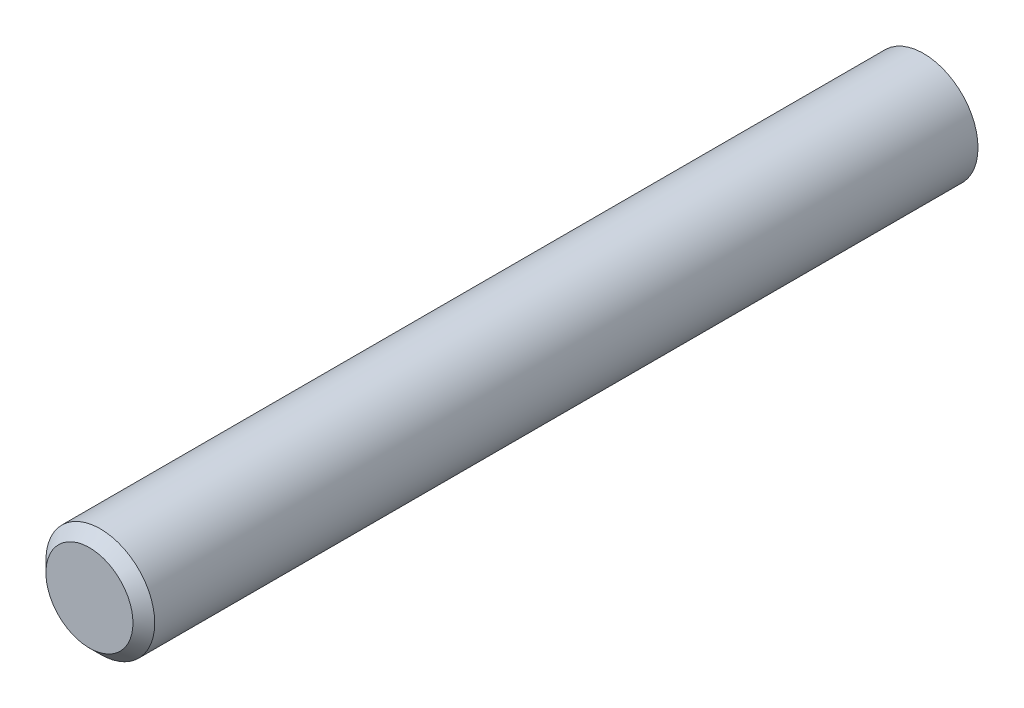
ISO-10303-21;
HEADER;
FILE_DESCRIPTION(('STEP AP214'),'2;1');
FILE_NAME('part.step','',(''),(''),'','','');
FILE_SCHEMA(('AUTOMOTIVE_DESIGN { 1 0 10303 214 1 1 1 1 }'));
ENDSEC;
DATA;
#1=APPLICATION_CONTEXT('core data for automotive mechanical design processes');
#2=APPLICATION_PROTOCOL_DEFINITION('international standard','automotive_design',2000,#1);
#3=PRODUCT_CONTEXT('',#1,'mechanical');
#4=PRODUCT('Part','Part','',(#3));
#5=PRODUCT_RELATED_PRODUCT_CATEGORY('part','',(#4));
#6=PRODUCT_DEFINITION_FORMATION('','',#4);
#7=PRODUCT_DEFINITION_CONTEXT('part definition',#1,'design');
#8=PRODUCT_DEFINITION('design','',#6,#7);
#9=PRODUCT_DEFINITION_SHAPE('','',#8);
#10=(LENGTH_UNIT() NAMED_UNIT(*) SI_UNIT(.MILLI.,.METRE.));
#11=(NAMED_UNIT(*) PLANE_ANGLE_UNIT() SI_UNIT($,.RADIAN.));
#12=(NAMED_UNIT(*) SI_UNIT($,.STERADIAN.) SOLID_ANGLE_UNIT());
#13=UNCERTAINTY_MEASURE_WITH_UNIT(LENGTH_MEASURE(1.E-05),#10,'distance_accuracy_value','');
#14=(GEOMETRIC_REPRESENTATION_CONTEXT(3) GLOBAL_UNCERTAINTY_ASSIGNED_CONTEXT((#13)) GLOBAL_UNIT_ASSIGNED_CONTEXT((#10,
#11,#12)) REPRESENTATION_CONTEXT('',''));
#15=CARTESIAN_POINT('',(0.,0.,0.));
#16=DIRECTION('',(0.,0.,1.));
#17=DIRECTION('',(1.,0.,0.));
#18=AXIS2_PLACEMENT_3D('',#15,#16,#17);
#19=CARTESIAN_POINT('',(0.,0.,115.));
#20=DIRECTION('',(0.,0.,-1.));
#21=DIRECTION('',(-1.,0.,0.));
#22=AXIS2_PLACEMENT_3D('',#19,#20,#21);
#23=CYLINDRICAL_SURFACE('',#22,7.5);
#24=CARTESIAN_POINT('',(0.,0.,113.5));
#25=DIRECTION('',(0.,0.,1.));
#26=DIRECTION('',(1.,0.,0.));
#27=AXIS2_PLACEMENT_3D('',#24,#25,#26);
#28=CIRCLE('',#27,7.5);
#29=CARTESIAN_POINT('',(7.5,0.,113.5));
#30=VERTEX_POINT('',#29);
#31=EDGE_CURVE('E11',#30,#30,#28,.F.);
#32=ORIENTED_EDGE('',*,*,#31,.T.);
#33=EDGE_LOOP('',(#32));
#34=FACE_BOUND('',#33,.T.);
#35=CARTESIAN_POINT('',(0.,0.,0.));
#36=DIRECTION('',(0.,0.,1.));
#37=DIRECTION('',(1.,0.,0.));
#38=AXIS2_PLACEMENT_3D('',#35,#36,#37);
#39=CIRCLE('',#38,7.5);
#40=CARTESIAN_POINT('',(7.5,0.,0.));
#41=VERTEX_POINT('',#40);
#42=EDGE_CURVE('E70',#41,#41,#39,.T.);
#43=ORIENTED_EDGE('',*,*,#42,.T.);
#44=EDGE_LOOP('',(#43));
#45=FACE_BOUND('',#44,.T.);
#46=ADVANCED_FACE('F44',(#34,#45),#23,.T.);
#47=CARTESIAN_POINT('',(0.,0.,115.));
#48=DIRECTION('',(0.,0.,1.));
#49=DIRECTION('',(1.,0.,0.));
#50=AXIS2_PLACEMENT_3D('',#47,#48,#49);
#51=PLANE('',#50);
#52=CARTESIAN_POINT('',(0.,0.,115.));
#53=DIRECTION('',(0.,0.,1.));
#54=DIRECTION('',(1.,0.,0.));
#55=AXIS2_PLACEMENT_3D('',#52,#53,#54);
#56=CIRCLE('',#55,6.);
#57=CARTESIAN_POINT('',(6.,0.,115.));
#58=VERTEX_POINT('',#57);
#59=EDGE_CURVE('E51',#58,#58,#56,.T.);
#60=ORIENTED_EDGE('',*,*,#59,.T.);
#61=EDGE_LOOP('',(#60));
#62=FACE_BOUND('',#61,.T.);
#63=ADVANCED_FACE('F78',(#62),#51,.T.);
#64=CARTESIAN_POINT('',(0.,0.,0.));
#65=DIRECTION('',(0.,0.,1.));
#66=DIRECTION('',(1.,0.,0.));
#67=AXIS2_PLACEMENT_3D('',#64,#65,#66);
#68=PLANE('',#67);
#69=CARTESIAN_POINT('',(0.,0.,0.));
#70=DIRECTION('',(0.,0.,-1.));
#71=DIRECTION('',(-1.,0.,0.));
#72=AXIS2_PLACEMENT_3D('',#69,#70,#71);
#73=CIRCLE('',#72,2.49999999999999);
#74=CARTESIAN_POINT('',(-2.49999999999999,0.,0.));
#75=VERTEX_POINT('',#74);
#76=EDGE_CURVE('E65',#75,#75,#73,.T.);
#77=ORIENTED_EDGE('',*,*,#76,.F.);
#78=EDGE_LOOP('',(#77));
#79=FACE_BOUND('',#78,.T.);
#80=ORIENTED_EDGE('',*,*,#42,.F.);
#81=EDGE_LOOP('',(#80));
#82=FACE_BOUND('',#81,.T.);
#83=ADVANCED_FACE('F91',(#79,#82),#68,.F.);
#84=CARTESIAN_POINT('',(0.,0.,0.));
#85=DIRECTION('',(0.,0.,-1.));
#86=DIRECTION('',(-1.,0.,0.));
#87=AXIS2_PLACEMENT_3D('',#84,#85,#86);
#88=CYLINDRICAL_SURFACE('',#87,2.49999999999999);
#89=CARTESIAN_POINT('',(0.,0.,15.));
#90=DIRECTION('',(0.,0.,-1.));
#91=DIRECTION('',(-1.,0.,0.));
#92=AXIS2_PLACEMENT_3D('',#89,#90,#91);
#93=CIRCLE('',#92,2.49999999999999);
#94=CARTESIAN_POINT('',(-2.49999999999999,0.,15.));
#95=VERTEX_POINT('',#94);
#96=EDGE_CURVE('E62',#95,#95,#93,.T.);
#97=ORIENTED_EDGE('',*,*,#96,.F.);
#98=EDGE_LOOP('',(#97));
#99=FACE_BOUND('',#98,.T.);
#100=ORIENTED_EDGE('',*,*,#76,.T.);
#101=EDGE_LOOP('',(#100));
#102=FACE_BOUND('',#101,.T.);
#103=ADVANCED_FACE('F58',(#99,#102),#88,.F.);
#104=CARTESIAN_POINT('',(0.,0.,15.));
#105=DIRECTION('',(0.,0.,-1.));
#106=DIRECTION('',(-1.,0.,0.));
#107=AXIS2_PLACEMENT_3D('',#104,#105,#106);
#108=CONICAL_SURFACE('',#107,2.49999999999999,1.02974425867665);
#109=CARTESIAN_POINT('',(0.,0.,16.5021515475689));
#110=VERTEX_POINT('',#109);
#111=VERTEX_LOOP('',#110);
#112=FACE_BOUND('',#111,.T.);
#113=ORIENTED_EDGE('',*,*,#96,.T.);
#114=EDGE_LOOP('',(#113));
#115=FACE_BOUND('',#114,.T.);
#116=ADVANCED_FACE('F54',(#112,#115),#108,.F.);
#117=CARTESIAN_POINT('',(0.,0.,115.));
#118=DIRECTION('',(0.,0.,-1.));
#119=DIRECTION('',(-1.,0.,0.));
#120=AXIS2_PLACEMENT_3D('',#117,#118,#119);
#121=CONICAL_SURFACE('',#120,6.,0.785398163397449);
#122=ORIENTED_EDGE('',*,*,#31,.F.);
#123=EDGE_LOOP('',(#122));
#124=FACE_BOUND('',#123,.T.);
#125=ORIENTED_EDGE('',*,*,#59,.F.);
#126=EDGE_LOOP('',(#125));
#127=FACE_BOUND('',#126,.T.);
#128=ADVANCED_FACE('F57',(#124,#127),#121,.T.);
#129=CLOSED_SHELL('',(#46,#63,#83,#103,#116,#128));
#130=MANIFOLD_SOLID_BREP('B2',#129);
#131=ADVANCED_BREP_SHAPE_REPRESENTATION('',(#18,#130),#14);
#132=SHAPE_DEFINITION_REPRESENTATION(#9,#131);
ENDSEC;
END-ISO-10303-21;
